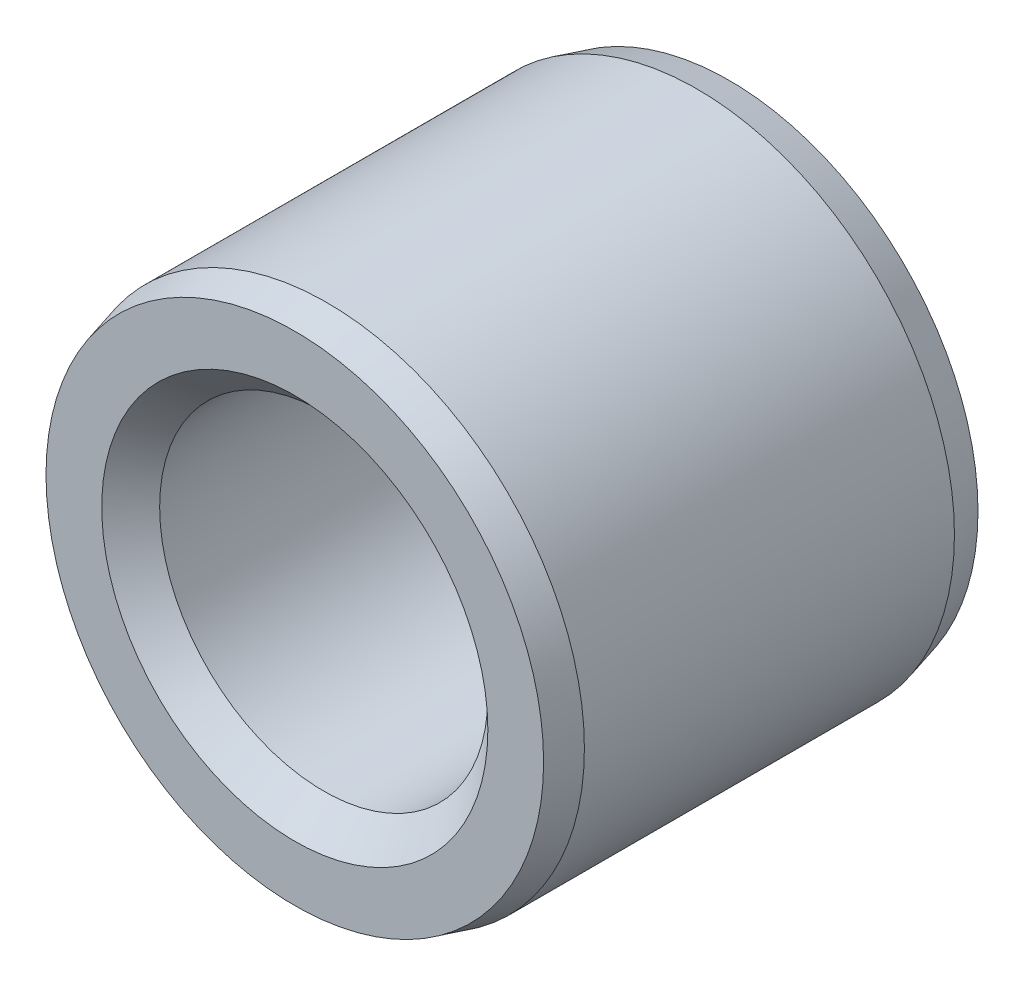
from build123d import *


with BuildPart() as part:
    # Sketch1 → Revolve1 (revolve)
    with BuildSketch(Plane(origin=(0, 0, 0), x_dir=(0, 0, -1), z_dir=(1, 0, 0)), mode=Mode.PRIVATE) as revolve1_sk:
        Polygon((5.85, 5.1), (-5.85, 5.1), (-6.75, 6), (-6.75, 7.732050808), (-5.75, 8), (5.75, 8), (6.75, 7.732050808), (6.75, 6), (-6.735857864, 6), (-6.725857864, 5.99), (6.74, 5.99), align=None)
    revolve(revolve1_sk.sketch.rotate(Axis((0, 0, 6.75), (0, 0, -1)), 90), axis=Axis((0, 0, 6.75), (0, 0, -1)))


solid = part.part
